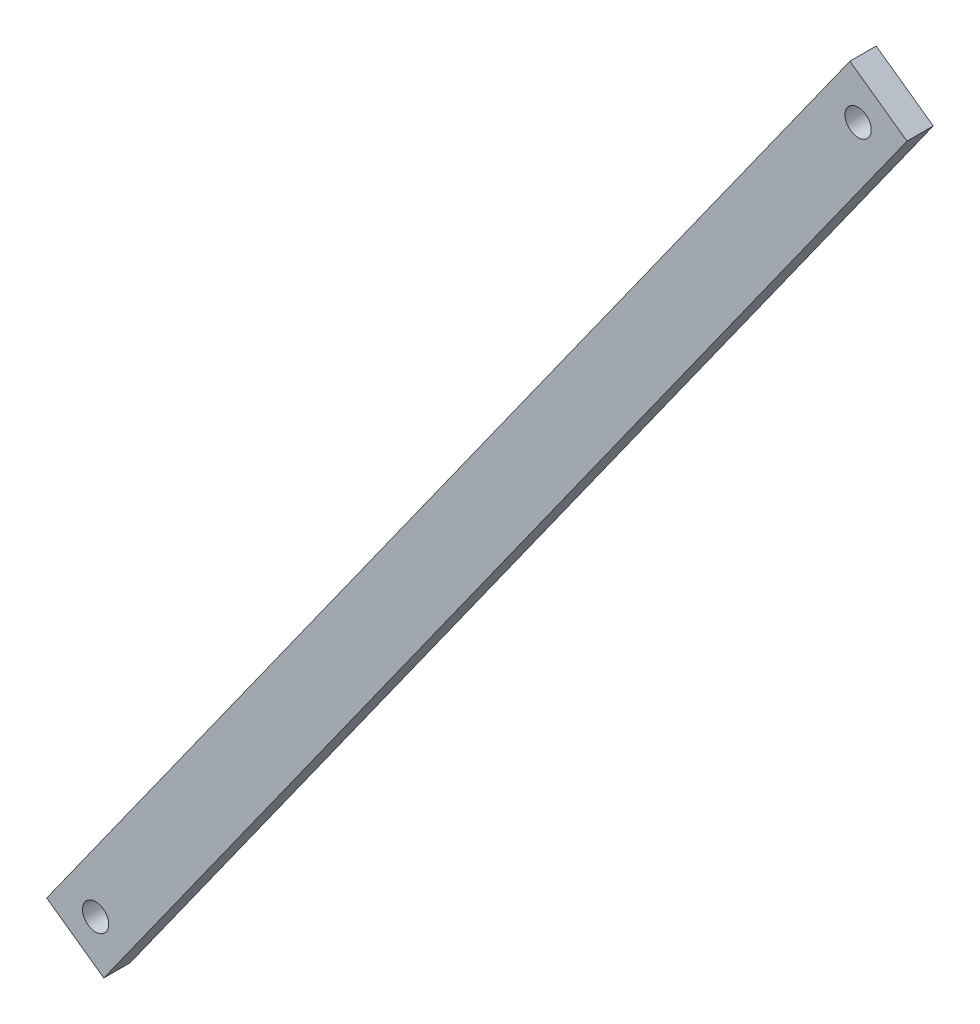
ISO-10303-21;
HEADER;
FILE_DESCRIPTION(('STEP AP214'),'2;1');
FILE_NAME('part.step','',(''),(''),'','','');
FILE_SCHEMA(('AUTOMOTIVE_DESIGN { 1 0 10303 214 1 1 1 1 }'));
ENDSEC;
DATA;
#1=APPLICATION_CONTEXT('core data for automotive mechanical design processes');
#2=APPLICATION_PROTOCOL_DEFINITION('international standard','automotive_design',2000,#1);
#3=PRODUCT_CONTEXT('',#1,'mechanical');
#4=PRODUCT('Part','Part','',(#3));
#5=PRODUCT_RELATED_PRODUCT_CATEGORY('part','',(#4));
#6=PRODUCT_DEFINITION_FORMATION('','',#4);
#7=PRODUCT_DEFINITION_CONTEXT('part definition',#1,'design');
#8=PRODUCT_DEFINITION('design','',#6,#7);
#9=PRODUCT_DEFINITION_SHAPE('','',#8);
#10=(LENGTH_UNIT() NAMED_UNIT(*) SI_UNIT(.MILLI.,.METRE.));
#11=(NAMED_UNIT(*) PLANE_ANGLE_UNIT() SI_UNIT($,.RADIAN.));
#12=(NAMED_UNIT(*) SI_UNIT($,.STERADIAN.) SOLID_ANGLE_UNIT());
#13=UNCERTAINTY_MEASURE_WITH_UNIT(LENGTH_MEASURE(1.E-05),#10,'distance_accuracy_value','');
#14=(GEOMETRIC_REPRESENTATION_CONTEXT(3) GLOBAL_UNCERTAINTY_ASSIGNED_CONTEXT((#13)) GLOBAL_UNIT_ASSIGNED_CONTEXT((#10,
#11,#12)) REPRESENTATION_CONTEXT('',''));
#15=CARTESIAN_POINT('',(0.,0.,0.));
#16=DIRECTION('',(0.,0.,1.));
#17=DIRECTION('',(1.,0.,0.));
#18=AXIS2_PLACEMENT_3D('',#15,#16,#17);
#19=CARTESIAN_POINT('',(92.579163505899,122.934309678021,3.));
#20=DIRECTION('',(0.,0.,-1.));
#21=DIRECTION('',(-1.,0.,0.));
#22=AXIS2_PLACEMENT_3D('',#19,#20,#21);
#23=PLANE('',#22);
#24=CARTESIAN_POINT('',(87.,122.,3.));
#25=DIRECTION('',(0.,0.,1.));
#26=DIRECTION('',(1.,0.,0.));
#27=AXIS2_PLACEMENT_3D('',#24,#25,#26);
#28=CIRCLE('',#27,1.5);
#29=CARTESIAN_POINT('',(88.5,122.,3.));
#30=VERTEX_POINT('',#29);
#31=EDGE_CURVE('E85',#30,#30,#28,.T.);
#32=ORIENTED_EDGE('',*,*,#31,.F.);
#33=EDGE_LOOP('',(#32));
#34=FACE_BOUND('',#33,.T.);
#35=DIRECTION('',(-0.814184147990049,0.580606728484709,0.));
#36=VECTOR('',#35,1.);
#37=CARTESIAN_POINT('',(92.579163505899,122.934309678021,3.));
#38=LINE('',#37,#36);
#39=CARTESIAN_POINT('',(92.579163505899,122.934309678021,3.));
#40=VERTEX_POINT('',#39);
#41=CARTESIAN_POINT('',(86.0656903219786,127.579163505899,3.));
#42=VERTEX_POINT('',#41);
#43=EDGE_CURVE('E95',#40,#42,#38,.T.);
#44=ORIENTED_EDGE('',*,*,#43,.T.);
#45=DIRECTION('',(-0.580606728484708,-0.814184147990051,0.));
#46=VECTOR('',#45,1.);
#47=CARTESIAN_POINT('',(86.0656903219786,127.579163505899,3.));
#48=LINE('',#47,#46);
#49=CARTESIAN_POINT('',(-5.57916350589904,-0.934309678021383,3.));
#50=VERTEX_POINT('',#49);
#51=EDGE_CURVE('E80',#42,#50,#48,.T.);
#52=ORIENTED_EDGE('',*,*,#51,.T.);
#53=DIRECTION('',(0.814184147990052,-0.580606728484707,0.));
#54=VECTOR('',#53,1.);
#55=CARTESIAN_POINT('',(-5.57916350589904,-0.934309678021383,3.));
#56=LINE('',#55,#54);
#57=CARTESIAN_POINT('',(0.93430967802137,-5.57916350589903,3.));
#58=VERTEX_POINT('',#57);
#59=EDGE_CURVE('E46',#50,#58,#56,.T.);
#60=ORIENTED_EDGE('',*,*,#59,.T.);
#61=DIRECTION('',(0.580606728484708,0.814184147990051,0.));
#62=VECTOR('',#61,1.);
#63=CARTESIAN_POINT('',(0.93430967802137,-5.57916350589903,3.));
#64=LINE('',#63,#62);
#65=EDGE_CURVE('E41',#58,#40,#64,.T.);
#66=ORIENTED_EDGE('',*,*,#65,.T.);
#67=EDGE_LOOP('',(#44,#52,#60,#66));
#68=FACE_BOUND('',#67,.T.);
#69=CARTESIAN_POINT('',(0.,0.,3.));
#70=DIRECTION('',(0.,0.,1.));
#71=DIRECTION('',(1.,0.,0.));
#72=AXIS2_PLACEMENT_3D('',#69,#70,#71);
#73=CIRCLE('',#72,1.5);
#74=CARTESIAN_POINT('',(1.5,0.,3.));
#75=VERTEX_POINT('',#74);
#76=EDGE_CURVE('E113',#75,#75,#73,.T.);
#77=ORIENTED_EDGE('',*,*,#76,.F.);
#78=EDGE_LOOP('',(#77));
#79=FACE_BOUND('',#78,.T.);
#80=ADVANCED_FACE('F26',(#34,#68,#79),#23,.F.);
#81=CARTESIAN_POINT('',(92.579163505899,122.934309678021,0.));
#82=DIRECTION('',(0.,0.,-1.));
#83=DIRECTION('',(-1.,0.,0.));
#84=AXIS2_PLACEMENT_3D('',#81,#82,#83);
#85=PLANE('',#84);
#86=CARTESIAN_POINT('',(87.,122.,0.));
#87=DIRECTION('',(0.,0.,1.));
#88=DIRECTION('',(1.,0.,0.));
#89=AXIS2_PLACEMENT_3D('',#86,#87,#88);
#90=CIRCLE('',#89,1.5);
#91=CARTESIAN_POINT('',(88.5,122.,0.));
#92=VERTEX_POINT('',#91);
#93=EDGE_CURVE('E88',#92,#92,#90,.T.);
#94=ORIENTED_EDGE('',*,*,#93,.T.);
#95=EDGE_LOOP('',(#94));
#96=FACE_BOUND('',#95,.T.);
#97=DIRECTION('',(-0.814184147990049,0.580606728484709,0.));
#98=VECTOR('',#97,1.);
#99=CARTESIAN_POINT('',(92.579163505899,122.934309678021,0.));
#100=LINE('',#99,#98);
#101=CARTESIAN_POINT('',(92.579163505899,122.934309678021,0.));
#102=VERTEX_POINT('',#101);
#103=CARTESIAN_POINT('',(86.0656903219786,127.579163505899,0.));
#104=VERTEX_POINT('',#103);
#105=EDGE_CURVE('E72',#102,#104,#100,.T.);
#106=ORIENTED_EDGE('',*,*,#105,.F.);
#107=DIRECTION('',(0.580606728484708,0.814184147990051,0.));
#108=VECTOR('',#107,1.);
#109=CARTESIAN_POINT('',(0.93430967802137,-5.57916350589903,0.));
#110=LINE('',#109,#108);
#111=CARTESIAN_POINT('',(0.93430967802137,-5.57916350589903,0.));
#112=VERTEX_POINT('',#111);
#113=EDGE_CURVE('E93',#112,#102,#110,.T.);
#114=ORIENTED_EDGE('',*,*,#113,.F.);
#115=DIRECTION('',(0.814184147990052,-0.580606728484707,0.));
#116=VECTOR('',#115,1.);
#117=CARTESIAN_POINT('',(-5.57916350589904,-0.934309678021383,0.));
#118=LINE('',#117,#116);
#119=CARTESIAN_POINT('',(-5.57916350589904,-0.934309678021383,0.));
#120=VERTEX_POINT('',#119);
#121=EDGE_CURVE('E73',#120,#112,#118,.T.);
#122=ORIENTED_EDGE('',*,*,#121,.F.);
#123=DIRECTION('',(-0.580606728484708,-0.814184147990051,0.));
#124=VECTOR('',#123,1.);
#125=CARTESIAN_POINT('',(86.0656903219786,127.579163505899,0.));
#126=LINE('',#125,#124);
#127=EDGE_CURVE('E67',#104,#120,#126,.T.);
#128=ORIENTED_EDGE('',*,*,#127,.F.);
#129=EDGE_LOOP('',(#106,#114,#122,#128));
#130=FACE_BOUND('',#129,.T.);
#131=CARTESIAN_POINT('',(0.,0.,0.));
#132=DIRECTION('',(0.,0.,1.));
#133=DIRECTION('',(1.,0.,0.));
#134=AXIS2_PLACEMENT_3D('',#131,#132,#133);
#135=CIRCLE('',#134,1.5);
#136=CARTESIAN_POINT('',(1.5,0.,0.));
#137=VERTEX_POINT('',#136);
#138=EDGE_CURVE('E115',#137,#137,#135,.T.);
#139=ORIENTED_EDGE('',*,*,#138,.T.);
#140=EDGE_LOOP('',(#139));
#141=FACE_BOUND('',#140,.T.);
#142=ADVANCED_FACE('F68',(#96,#130,#141),#85,.T.);
#143=CARTESIAN_POINT('',(92.579163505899,122.934309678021,3.));
#144=DIRECTION('',(-0.58060672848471,-0.81418414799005,0.));
#145=DIRECTION('',(0.81418414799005,-0.58060672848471,0.));
#146=AXIS2_PLACEMENT_3D('',#143,#144,#145);
#147=PLANE('',#146);
#148=ORIENTED_EDGE('',*,*,#105,.T.);
#149=DIRECTION('',(0.,0.,-1.));
#150=VECTOR('',#149,1.);
#151=CARTESIAN_POINT('',(86.0656903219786,127.579163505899,3.));
#152=LINE('',#151,#150);
#153=EDGE_CURVE('E11',#42,#104,#152,.T.);
#154=ORIENTED_EDGE('',*,*,#153,.F.);
#155=ORIENTED_EDGE('',*,*,#43,.F.);
#156=DIRECTION('',(0.,0.,-1.));
#157=VECTOR('',#156,1.);
#158=CARTESIAN_POINT('',(92.579163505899,122.934309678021,3.));
#159=LINE('',#158,#157);
#160=EDGE_CURVE('E84',#40,#102,#159,.T.);
#161=ORIENTED_EDGE('',*,*,#160,.T.);
#162=EDGE_LOOP('',(#148,#154,#155,#161));
#163=FACE_BOUND('',#162,.T.);
#164=ADVANCED_FACE('F28',(#163),#147,.F.);
#165=CARTESIAN_POINT('',(86.0656903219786,127.579163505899,3.));
#166=DIRECTION('',(0.814184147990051,-0.580606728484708,0.));
#167=DIRECTION('',(0.580606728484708,0.814184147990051,0.));
#168=AXIS2_PLACEMENT_3D('',#165,#166,#167);
#169=PLANE('',#168);
#170=ORIENTED_EDGE('',*,*,#127,.T.);
#171=DIRECTION('',(0.,0.,-1.));
#172=VECTOR('',#171,1.);
#173=CARTESIAN_POINT('',(-5.57916350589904,-0.934309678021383,3.));
#174=LINE('',#173,#172);
#175=EDGE_CURVE('E34',#50,#120,#174,.T.);
#176=ORIENTED_EDGE('',*,*,#175,.F.);
#177=ORIENTED_EDGE('',*,*,#51,.F.);
#178=ORIENTED_EDGE('',*,*,#153,.T.);
#179=EDGE_LOOP('',(#170,#176,#177,#178));
#180=FACE_BOUND('',#179,.T.);
#181=ADVANCED_FACE('F79',(#180),#169,.F.);
#182=CARTESIAN_POINT('',(-5.57916350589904,-0.934309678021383,3.));
#183=DIRECTION('',(0.580606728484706,0.814184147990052,0.));
#184=DIRECTION('',(-0.814184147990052,0.580606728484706,0.));
#185=AXIS2_PLACEMENT_3D('',#182,#183,#184);
#186=PLANE('',#185);
#187=ORIENTED_EDGE('',*,*,#121,.T.);
#188=DIRECTION('',(0.,0.,-1.));
#189=VECTOR('',#188,1.);
#190=CARTESIAN_POINT('',(0.93430967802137,-5.57916350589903,3.));
#191=LINE('',#190,#189);
#192=EDGE_CURVE('E101',#58,#112,#191,.T.);
#193=ORIENTED_EDGE('',*,*,#192,.F.);
#194=ORIENTED_EDGE('',*,*,#59,.F.);
#195=ORIENTED_EDGE('',*,*,#175,.T.);
#196=EDGE_LOOP('',(#187,#193,#194,#195));
#197=FACE_BOUND('',#196,.T.);
#198=ADVANCED_FACE('F104',(#197),#186,.F.);
#199=CARTESIAN_POINT('',(0.93430967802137,-5.57916350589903,3.));
#200=DIRECTION('',(-0.814184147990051,0.580606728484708,0.));
#201=DIRECTION('',(-0.580606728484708,-0.814184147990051,0.));
#202=AXIS2_PLACEMENT_3D('',#199,#200,#201);
#203=PLANE('',#202);
#204=ORIENTED_EDGE('',*,*,#113,.T.);
#205=ORIENTED_EDGE('',*,*,#160,.F.);
#206=ORIENTED_EDGE('',*,*,#65,.F.);
#207=ORIENTED_EDGE('',*,*,#192,.T.);
#208=EDGE_LOOP('',(#204,#205,#206,#207));
#209=FACE_BOUND('',#208,.T.);
#210=ADVANCED_FACE('F106',(#209),#203,.F.);
#211=CARTESIAN_POINT('',(87.,122.,3.));
#212=DIRECTION('',(0.,0.,-1.));
#213=DIRECTION('',(-1.,0.,0.));
#214=AXIS2_PLACEMENT_3D('',#211,#212,#213);
#215=CYLINDRICAL_SURFACE('',#214,1.5);
#216=ORIENTED_EDGE('',*,*,#31,.T.);
#217=EDGE_LOOP('',(#216));
#218=FACE_BOUND('',#217,.T.);
#219=ORIENTED_EDGE('',*,*,#93,.F.);
#220=EDGE_LOOP('',(#219));
#221=FACE_BOUND('',#220,.T.);
#222=ADVANCED_FACE('F124',(#218,#221),#215,.F.);
#223=CARTESIAN_POINT('',(0.,0.,3.));
#224=DIRECTION('',(0.,0.,-1.));
#225=DIRECTION('',(-1.,0.,0.));
#226=AXIS2_PLACEMENT_3D('',#223,#224,#225);
#227=CYLINDRICAL_SURFACE('',#226,1.5);
#228=ORIENTED_EDGE('',*,*,#76,.T.);
#229=EDGE_LOOP('',(#228));
#230=FACE_BOUND('',#229,.T.);
#231=ORIENTED_EDGE('',*,*,#138,.F.);
#232=EDGE_LOOP('',(#231));
#233=FACE_BOUND('',#232,.T.);
#234=ADVANCED_FACE('F122',(#230,#233),#227,.F.);
#235=CLOSED_SHELL('',(#80,#142,#164,#181,#198,#210,#222,#234));
#236=MANIFOLD_SOLID_BREP('B2',#235);
#237=ADVANCED_BREP_SHAPE_REPRESENTATION('',(#18,#236),#14);
#238=SHAPE_DEFINITION_REPRESENTATION(#9,#237);
ENDSEC;
END-ISO-10303-21;
